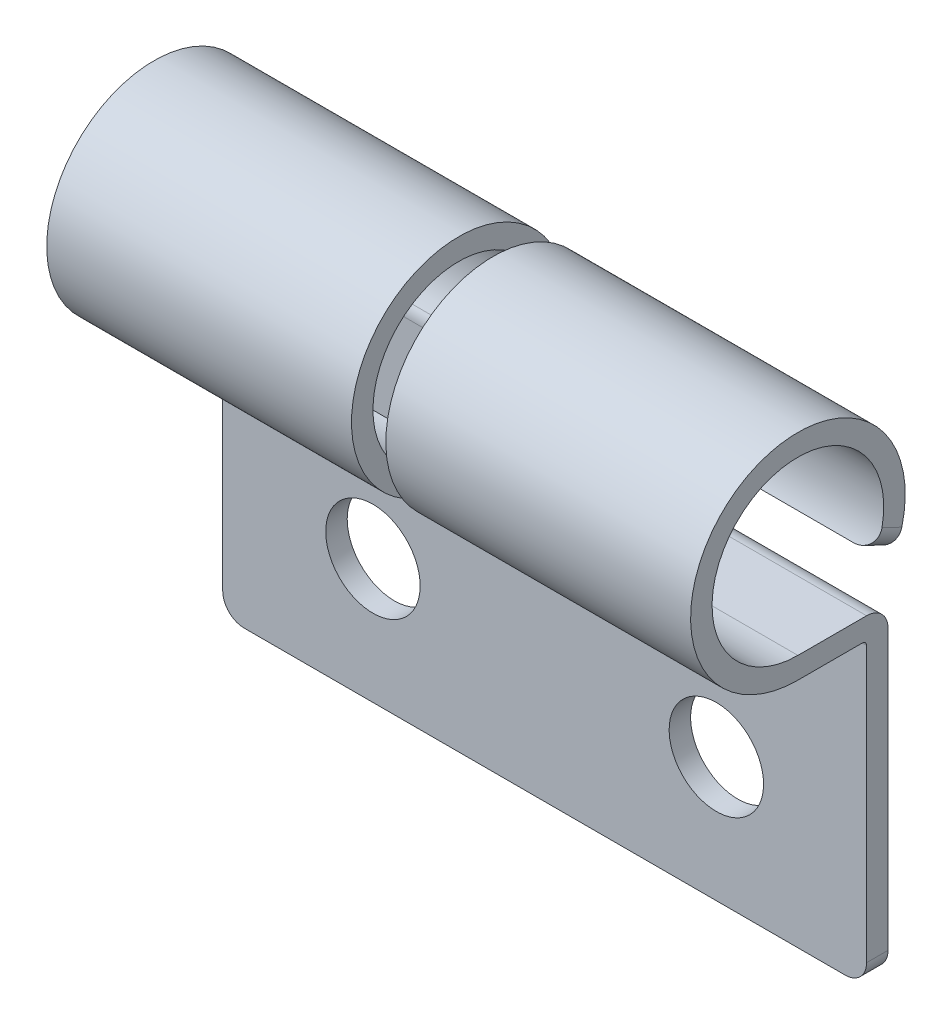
from build123d import *

# Parameters (mm, degrees)
EXTRUDE_THIN1_DEPTH = 7.5
EXTRUDE_THIN2_START = 7.5
EXTRUDE_THIN2_DEPTH = 7.5
CUT_EXTRUDE2_DEPTH  = 2.5
SKETCH2_R           = 1.1
CUT_EXTRUDE1_DEPTH  = 13.948358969
FILLET1_R           = 0.5
FILLET2_R           = 0.1


with BuildPart() as part:
    # Sketch1 → Extrude-Thin1 (new body)
    with BuildSketch(Plane(origin=(0, 0, 0), x_dir=(0, 0, -1), z_dir=(1, 0, 0))):
        with BuildLine():
            ThreePointArc((1.797618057, -0.876680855), (-1.059867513, 1.69607808), (0, -2))
            Line((0, -2), (1.6, -2))
            ThreePointArc((1.6, -2), (1.953553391, -2.146446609), (2.1, -2.5))
            Line((2.1, -2.5), (2.1, -9.5))
            Line((2.1, -9.5), (1.6, -9.5))
            Line((1.6, -9.5), (1.6, -2.5))
            Line((1.6, -2.5), (0, -2.5))
            ThreePointArc((0, -2.5), (-1.324834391, 2.1200976), (2.247022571, -1.095851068))
            Line((2.247022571, -1.095851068), (1.797618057, -0.876680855))
        make_face()
    extrude(amount=EXTRUDE_THIN1_DEPTH)

    # Sketch3 → Extrude-Thin2 (add)
    with BuildSketch(Plane.ZY.offset(EXTRUDE_THIN2_START)):
        with BuildLine():
            Line((-1.6, -9.5), (-1.6, -1.356465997))
            ThreePointArc((-1.6, -1.356465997), (-1.620416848, -1.21504464), (-1.68, -1.085172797))
            ThreePointArc((-1.68, -1.085172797), (0.956465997, 1.756465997), (0, -2))
            Line((0, -2), (0, -2.5))
            ThreePointArc((0, -2.5), (1.195582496, 2.195582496), (-2.1, -1.356465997))
            Line((-2.1, -1.356465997), (-2.1, -9.5))
            Line((-2.1, -9.5), (-1.6, -9.5))
        make_face()
    extrude(amount=-EXTRUDE_THIN2_DEPTH)

    # Sketch4 → Cut-Extrude2 (cut, symmetric)
    with BuildSketch(Plane.XY):
        with BuildLine():
            Line((-0.4, -3.1), (-0.4, 2.5))
            Line((-0.4, 2.5), (0.4, 2.5))
            Line((0.4, 2.5), (0.4, -3.1))
            ThreePointArc((0.4, -3.1), (0, -3.5), (-0.4, -3.1))
        make_face()
    extrude(amount=CUT_EXTRUDE2_DEPTH, both=True, mode=Mode.SUBTRACT)

    # Sketch2 → Cut-Extrude1 (cut, through all)
    with BuildSketch(Plane(origin=(0, 0, -2.1), x_dir=(-1, 0, 0), z_dir=(0, 0, -1))):
        with Locations(Location((4, -6.6, 0), (0, 0, 90))):
            Circle(SKETCH2_R)
        with Locations(Location((-4, -6.6, 0), (0, 0, 90))):
            Circle(SKETCH2_R)
    extrude(amount=-CUT_EXTRUDE1_DEPTH, mode=Mode.SUBTRACT)

    # Fillet1
    fillet1_edges = [part.edges().sort_by_distance(p)[0] for p in [
        (7.5, -0.986265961, -2.022320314),
        (-7.5, -9.5, -1.85),
        (-7.5, -2.25, 0),
        (-0.4, -2.25, 0),
        (0.4, -0.986265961, -2.022320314),
        (7.5, -9.5, -1.85),
    ]]
    fillet(fillet1_edges, radius=FILLET1_R)

    # Fillet2
    fillet2_edges = [part.edges().sort_by_distance(p)[0] for p in [
        (3.95, -2.5, -1.6),
        (-3.95, -1.356465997, -2.1),
    ]]
    fillet(fillet2_edges, radius=FILLET2_R)


solid = part.part
